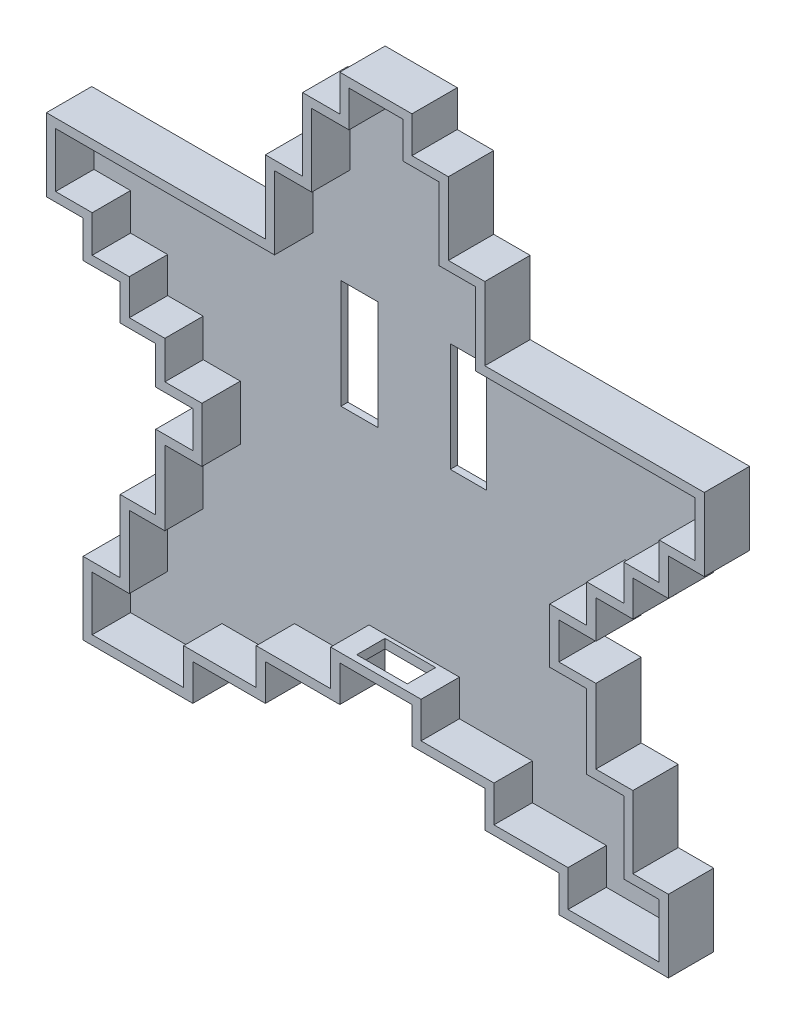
from build123d import *

# Parameters (mm, degrees)
SKETCH1_W           = 10.671985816
SKETCH1_H           = 31.228008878
SKETCH1_W_2         = 10.453073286
BOSS_EXTRUDE4_DEPTH = 2
BOSS_EXTRUDE5_DEPTH = 13
SKETCH2_W           = 14.504311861
SKETCH2_H           = 8.11998263
CUT_EXTRUDE1_DEPTH  = 10


with BuildPart() as part:
    # Sketch1 → Boss-Extrude4 (new body)
    with BuildSketch(Plane.XY):
        Polygon((-28.843980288, 97.699610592), (-28.843980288, 82.048487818), (-18.33158126, 82.048487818), (-18.33158126, 71.474251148), (-7.695506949, 71.474251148), (-7.695506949, 61.271040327), (2.507703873, 61.271040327), (2.507703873, 50.449453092), (13.143778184, 50.449453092), (13.143778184, 34.748891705), (2.507703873, 34.748891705), (2.507703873, 13.44612462), (-7.695506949, 13.44612462), (-7.695506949, -7.241109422), (-18.33158126, -7.241109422), (-18.33158126, -22.78779973), (7.893778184, -22.78779973), (7.893778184, -12.389454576), (28.709575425, -12.389454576), (28.709575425, -1.991109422), (50.053547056, -1.991109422), (50.053547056, 8.352507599), (75.990781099, 8.352507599), (75.990781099, -1.991109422), (96.896927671, -1.991109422), (96.896927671, -12.389454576), (118.131443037, -12.389454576), (118.131443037, -22.78779973), (144.295391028, -22.78779973), (144.295391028, -7.241109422), (134.115958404, -7.241109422), (134.115958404, 13.44612462), (123.49870072, 13.44612462), (123.49870072, 34.748891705), (112.881443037, 34.748891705), (112.881443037, 50.449453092), (123.49870072, 50.449453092), (123.49870072, 61.271040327), (134.115958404, 61.271040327), (134.115958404, 71.474251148), (144.295391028, 71.474251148), (144.295391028, 82.048487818), (154.584279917, 82.048487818), (154.584279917, 97.699610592), (91.646927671, 97.699610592), (91.646927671, 118.633595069), (81.193854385, 118.633595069), (81.193854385, 139.430285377), (70.740781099, 139.430285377), (70.740781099, 149.82863053), (55.303547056, 149.82863053), (55.303547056, 139.430285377), (44.63156124, 139.430285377), (44.63156124, 118.633595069), (33.959575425, 118.633595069), (33.959575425, 97.699610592), align=None)
        with Locations((47.342554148, 74.260044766)):
            Rectangle(SKETCH1_W, SKETCH1_H, mode=Mode.SUBTRACT)
        with Locations((78.592317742, 74.260044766)):
            Rectangle(SKETCH1_W_2, SKETCH1_H, mode=Mode.SUBTRACT)
    extrude(amount=BOSS_EXTRUDE4_DEPTH)

    # Sketch1_7 → Boss-Extrude5 (add)
    with BuildSketch(Plane.XY):
        Polygon((-31.468980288, 100.324610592), (-31.468980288, 79.423487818), (-20.95658126, 79.423487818), (-20.95658126, 68.849251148), (-10.320506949, 68.849251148), (-10.320506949, 58.646040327), (-0.117296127, 58.646040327), (-0.117296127, 47.824453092), (10.518778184, 47.824453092), (10.518778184, 37.373891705), (-0.117296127, 37.373891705), (-0.117296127, 16.07112462), (-10.320506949, 16.07112462), (-10.320506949, -4.616109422), (-20.95658126, -4.616109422), (-20.95658126, -25.41279973), (10.518778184, -25.41279973), (10.518778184, -15.014454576), (31.334575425, -15.014454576), (31.334575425, -4.616109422), (52.678547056, -4.616109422), (52.678547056, 5.727507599), (73.365781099, 5.727507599), (73.365781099, -4.616109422), (94.271927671, -4.616109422), (94.271927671, -15.014454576), (115.506443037, -15.014454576), (115.506443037, -25.41279973), (146.920391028, -25.41279973), (146.920391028, -4.616109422), (136.740958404, -4.616109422), (136.740958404, 16.07112462), (126.12370072, 16.07112462), (126.12370072, 37.373891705), (115.506443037, 37.373891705), (115.506443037, 47.824453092), (126.12370072, 47.824453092), (126.12370072, 58.646040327), (136.740958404, 58.646040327), (136.740958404, 68.849251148), (146.920391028, 68.849251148), (146.920391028, 79.423487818), (157.209279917, 79.423487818), (157.209279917, 100.324610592), (94.271927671, 100.324610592), (94.271927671, 121.258595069), (83.818854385, 121.258595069), (83.818854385, 142.055285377), (73.365781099, 142.055285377), (73.365781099, 152.45363053), (52.678547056, 152.45363053), (52.678547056, 142.055285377), (42.00656124, 142.055285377), (42.00656124, 121.258595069), (31.334575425, 121.258595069), (31.334575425, 100.324610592), align=None)
        Polygon((-28.843980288, 97.699610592), (-28.843980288, 82.048487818), (-18.33158126, 82.048487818), (-18.33158126, 71.474251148), (-7.695506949, 71.474251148), (-7.695506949, 61.271040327), (2.507703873, 61.271040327), (2.507703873, 50.449453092), (13.143778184, 50.449453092), (13.143778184, 34.748891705), (2.507703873, 34.748891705), (2.507703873, 13.44612462), (-7.695506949, 13.44612462), (-7.695506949, -7.241109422), (-18.33158126, -7.241109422), (-18.33158126, -22.78779973), (7.893778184, -22.78779973), (7.893778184, -12.389454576), (28.709575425, -12.389454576), (28.709575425, -1.991109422), (50.053547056, -1.991109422), (50.053547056, 8.352507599), (75.990781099, 8.352507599), (75.990781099, -1.991109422), (96.896927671, -1.991109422), (96.896927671, -12.389454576), (118.131443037, -12.389454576), (118.131443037, -22.78779973), (144.295391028, -22.78779973), (144.295391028, -7.241109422), (134.115958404, -7.241109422), (134.115958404, 13.44612462), (123.49870072, 13.44612462), (123.49870072, 34.748891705), (112.881443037, 34.748891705), (112.881443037, 50.449453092), (123.49870072, 50.449453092), (123.49870072, 61.271040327), (134.115958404, 61.271040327), (134.115958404, 71.474251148), (144.295391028, 71.474251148), (144.295391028, 82.048487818), (154.584279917, 82.048487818), (154.584279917, 97.699610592), (91.646927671, 97.699610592), (91.646927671, 118.633595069), (81.193854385, 118.633595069), (81.193854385, 139.430285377), (70.740781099, 139.430285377), (70.740781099, 149.82863053), (55.303547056, 149.82863053), (55.303547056, 139.430285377), (44.63156124, 139.430285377), (44.63156124, 118.633595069), (33.959575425, 118.633595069), (33.959575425, 97.699610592), align=None, mode=Mode.SUBTRACT)
    extrude(amount=BOSS_EXTRUDE5_DEPTH)

    # Sketch2 → Cut-Extrude1 (cut)
    with BuildSketch(Plane.XZ.offset(-5.727507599)):
        with Locations((62.942232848, 7.103841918)):
            Rectangle(SKETCH2_W, SKETCH2_H)
    extrude(amount=-CUT_EXTRUDE1_DEPTH, mode=Mode.SUBTRACT)


solid = part.part
